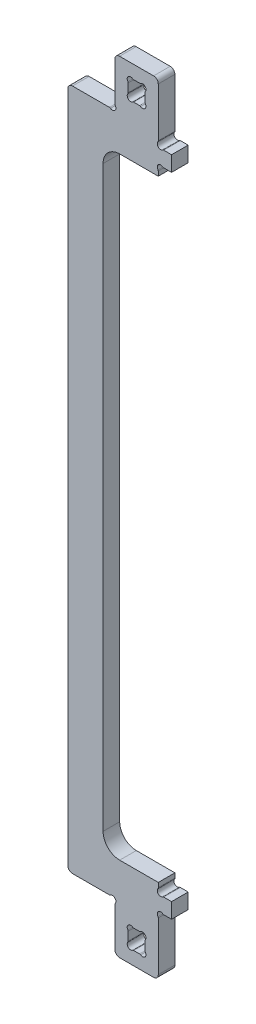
from build123d import *

# Parameters (mm, degrees)
BOSS_EXTRU_2_DEPTH = 25
CONG_1_R           = 7


with BuildPart() as part:
    # Esquisse2 → Boss.-Extru.2 (new body)
    with BuildSketch(Plane.XY):
        with BuildLine():
            Line((70.8, -74.166666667), (136, -74.166666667))
            Line((136, -74.166666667), (136, 6.868959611))
            ThreePointArc((136, 6.868959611), (135.873982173, 7.652674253), (135.508633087, 8.357379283))
            ThreePointArc((135.508633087, 8.357379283), (136, 15), (142.642620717, 15.491366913))
            ThreePointArc((142.642620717, 15.491366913), (143.347325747, 15.126017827), (144.131040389, 15))
            Line((144.131040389, 15), (156, 15))
            Line((156, 15), (156, 38))
            Line((156, 38), (144.131040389, 38))
            ThreePointArc((144.131040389, 38), (143.347325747, 37.873982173), (142.642620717, 37.508633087))
            ThreePointArc((142.642620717, 37.508633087), (136, 38), (135.508633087, 44.642620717))
            ThreePointArc((135.508633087, 44.642620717), (135.873982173, 45.347325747), (136, 46.131040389))
            Line((136, 46.131040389), (136, 53))
            Line((136, 53), (78, 53))
            ThreePointArc((78, 53), (60.32233047, 60.32233047), (53, 78))
            Line((53, 78), (53, 512.833333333))
            Line((53, 512.833333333), (0, 512.833333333))
            Line((0, 512.833333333), (0, 0))
            Line((0, 0), (62.668959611, 0))
            ThreePointArc((62.668959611, 0), (63.452674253, 0.126017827), (64.157379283, 0.491366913))
            ThreePointArc((64.157379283, 0.491366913), (70.8, 0), (71.291366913, -6.642620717))
            ThreePointArc((71.291366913, -6.642620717), (70.926017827, -7.347325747), (70.8, -8.131040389))
            Line((70.8, -8.131040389), (70.8, -74.166666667))
        make_face()
        with BuildLine():
            Line((116, -33.131040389), (116, -46.035626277))
            ThreePointArc((116, -46.035626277), (116.126017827, -46.81934092), (116.491366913, -47.52404595))
            ThreePointArc((116.491366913, -47.52404595), (116, -54.166666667), (109.357379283, -54.65803358))
            ThreePointArc((109.357379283, -54.65803358), (108.652674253, -54.292684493), (107.868959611, -54.166666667))
            Line((107.868959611, -54.166666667), (98.931040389, -54.166666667))
            ThreePointArc((98.931040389, -54.166666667), (98.147325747, -54.292684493), (97.442620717, -54.65803358))
            ThreePointArc((97.442620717, -54.65803358), (90.8, -54.166666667), (90.308633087, -47.52404595))
            ThreePointArc((90.308633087, -47.52404595), (90.673982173, -46.81934092), (90.8, -46.035626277))
            Line((90.8, -46.035626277), (90.8, -33.131040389))
            ThreePointArc((90.8, -33.131040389), (90.673982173, -32.347325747), (90.308633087, -31.642620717))
            ThreePointArc((90.308633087, -31.642620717), (90.8, -25), (97.442620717, -24.508633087))
            ThreePointArc((97.442620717, -24.508633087), (98.147325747, -24.873982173), (98.931040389, -25))
            Line((98.931040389, -25), (107.868959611, -25))
            ThreePointArc((107.868959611, -25), (108.652674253, -24.873982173), (109.357379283, -24.508633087))
            ThreePointArc((109.357379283, -24.508633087), (116, -25), (116.491366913, -31.642620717))
            ThreePointArc((116.491366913, -31.642620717), (116.126017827, -32.347325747), (116, -33.131040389))
        make_face(mode=Mode.SUBTRACT)
    extrude(amount=BOSS_EXTRU_2_DEPTH)

    # Cong_1
    cong_1_edges = [part.edges().sort_by_distance(p)[0] for p in [
        (0, 0, 12.5),
        (136, -74.166666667, 12.5),
        (70.8, -74.166666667, 12.5),
    ]]
    fillet(cong_1_edges, radius=CONG_1_R)

    # Sym_trie1: part across plane


with BuildPart() as part_1:
    add(part.part)
    add(part.part.mirror(Plane(origin=(53, 512.833333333, 25), x_dir=(0, 0, 1), z_dir=(0, -1, 0))))


solid = part_1.part
